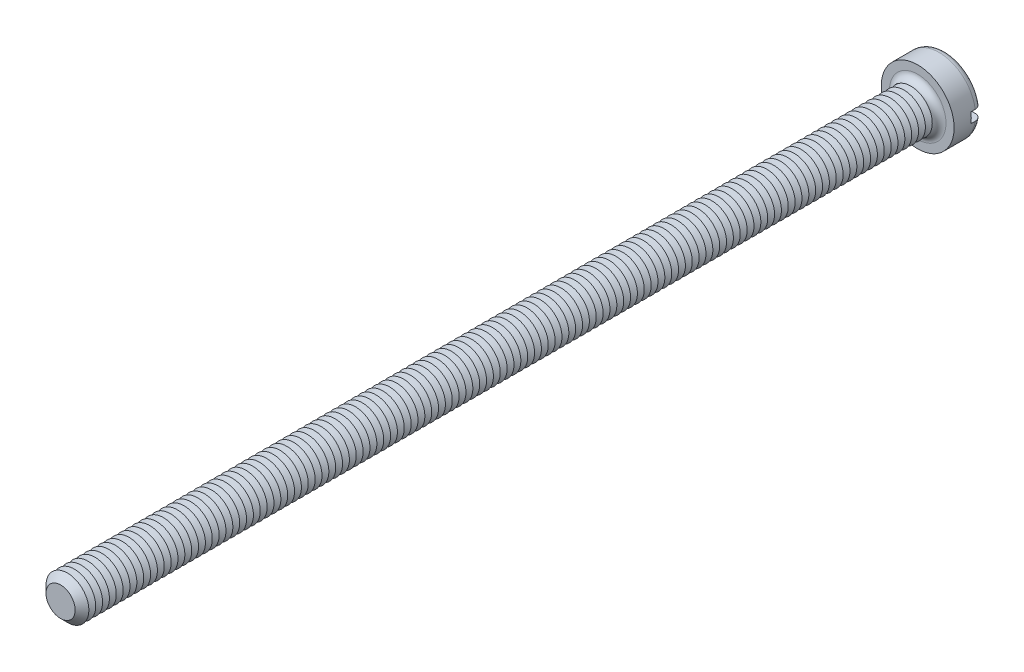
from build123d import *

# Parameters (mm, degrees)
SKETCH3_R           = 4.25
BOSS_EXTRUDE2_DEPTH = 3.3
SKETCH4_R           = 2.5
BOSS_EXTRUDE3_DEPTH = 100
FILLET1_R           = 0.8
CHAMFER1_SIZE       = 0.8
LPATTERN1_COUNT     = 123
LPATTERN1_PITCH     = 0.8
SKETCH8_W           = 8.5
SKETCH8_H           = 1.2
CUT_EXTRUDE1_DEPTH  = 1.3


with BuildPart() as part:
    # Sketch3 → Boss-Extrude2 (new body)
    with BuildSketch(Plane.XY):
        Circle(SKETCH3_R)
    extrude(amount=-BOSS_EXTRUDE2_DEPTH)

    # Sketch4 → Boss-Extrude3 (add)
    with BuildSketch(Plane.XY):
        Circle(SKETCH4_R)
    extrude(amount=BOSS_EXTRUDE3_DEPTH)

    # Fillet1
    fillet1_edges = [part.edges().sort_by_distance(p)[0] for p in [
        (-4.25, 0, -3.3),
        (-2.5, 0, 0),
    ]]
    fillet(fillet1_edges, radius=FILLET1_R)

    # Chamfer1
    chamfer1_edges = [part.edges().sort_by_distance(p)[0] for p in [
        (-2.5, 0, 100),
    ]]
    chamfer(chamfer1_edges, length=CHAMFER1_SIZE)

    # Sketch6 → Cut-Revolve1 (revolve, cut)
    with BuildSketch(Plane(origin=(0, 0, 0), x_dir=(0, 0, -1), z_dir=(1, 0, 0)), mode=Mode.PRIVATE) as cut_revolve1_sk:
        Polygon((-0.8, 2.5), (-1.2, 1.807179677), (-1.6, 2.5), align=None)
    cut_revolve1 = revolve(cut_revolve1_sk.sketch.rotate(Axis((0, 0, -1.694361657), (0, 0, 1)), 90), axis=Axis((0, 0, -1.694361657), (0, 0, 1)), mode=Mode.SUBTRACT)

    # LPattern1: Cut-Revolve1 ×123
    with Locations(*[(0, 0, i * LPATTERN1_PITCH) for i in range(1, LPATTERN1_COUNT)]):
        add(cut_revolve1, mode=Mode.SUBTRACT)

    # Sketch8 → Cut-Extrude1 (cut)
    with BuildSketch(Plane(origin=(0, 0, -3.3), x_dir=(-1, 0, 0), z_dir=(0, 0, -1))):
        Rectangle(SKETCH8_W, SKETCH8_H)
    extrude(amount=-CUT_EXTRUDE1_DEPTH, mode=Mode.SUBTRACT)


solid = part.part
